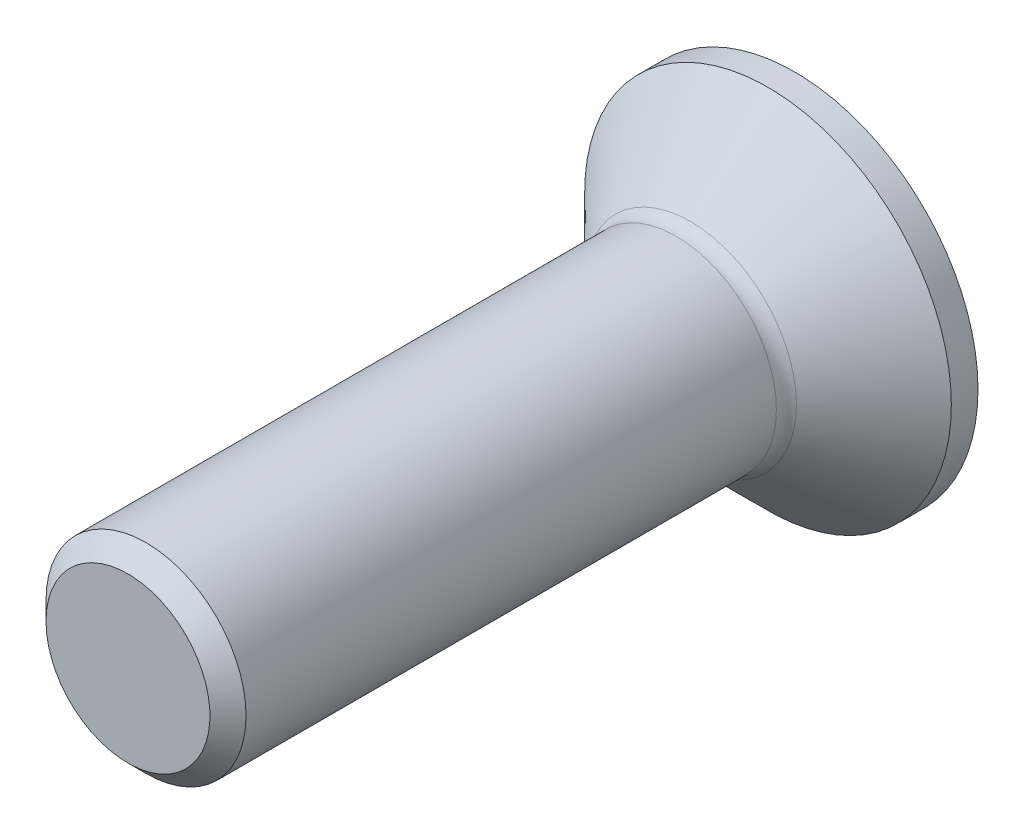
ISO-10303-21;
HEADER;
FILE_DESCRIPTION(('STEP AP214'),'2;1');
FILE_NAME('part.step','',(''),(''),'','','');
FILE_SCHEMA(('AUTOMOTIVE_DESIGN { 1 0 10303 214 1 1 1 1 }'));
ENDSEC;
DATA;
#1=APPLICATION_CONTEXT('core data for automotive mechanical design processes');
#2=APPLICATION_PROTOCOL_DEFINITION('international standard','automotive_design',2000,#1);
#3=PRODUCT_CONTEXT('',#1,'mechanical');
#4=PRODUCT('Part','Part','',(#3));
#5=PRODUCT_RELATED_PRODUCT_CATEGORY('part','',(#4));
#6=PRODUCT_DEFINITION_FORMATION('','',#4);
#7=PRODUCT_DEFINITION_CONTEXT('part definition',#1,'design');
#8=PRODUCT_DEFINITION('design','',#6,#7);
#9=PRODUCT_DEFINITION_SHAPE('','',#8);
#10=(LENGTH_UNIT() NAMED_UNIT(*) SI_UNIT(.MILLI.,.METRE.));
#11=(NAMED_UNIT(*) PLANE_ANGLE_UNIT() SI_UNIT($,.RADIAN.));
#12=(NAMED_UNIT(*) SI_UNIT($,.STERADIAN.) SOLID_ANGLE_UNIT());
#13=UNCERTAINTY_MEASURE_WITH_UNIT(LENGTH_MEASURE(1.E-05),#10,'distance_accuracy_value','');
#14=(GEOMETRIC_REPRESENTATION_CONTEXT(3) GLOBAL_UNCERTAINTY_ASSIGNED_CONTEXT((#13)) GLOBAL_UNIT_ASSIGNED_CONTEXT((#10,
#11,#12)) REPRESENTATION_CONTEXT('',''));
#15=CARTESIAN_POINT('',(0.,0.,0.));
#16=DIRECTION('',(0.,0.,1.));
#17=DIRECTION('',(1.,0.,0.));
#18=AXIS2_PLACEMENT_3D('',#15,#16,#17);
#19=CARTESIAN_POINT('',(0.,0.,-1.65));
#20=DIRECTION('',(0.,0.,-1.));
#21=DIRECTION('',(-1.,0.,0.));
#22=AXIS2_PLACEMENT_3D('',#19,#20,#21);
#23=CONICAL_SURFACE('',#22,3.15000000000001,0.78539816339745);
#24=CARTESIAN_POINT('',(0.,0.,-0.0878679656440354));
#25=DIRECTION('',(0.,0.,-1.));
#26=DIRECTION('',(-1.,0.,0.));
#27=AXIS2_PLACEMENT_3D('',#24,#25,#26);
#28=CIRCLE('',#27,1.58786796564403);
#29=CARTESIAN_POINT('',(-1.58786796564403,0.,-0.0878679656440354));
#30=VERTEX_POINT('',#29);
#31=EDGE_CURVE('E12',#30,#30,#28,.T.);
#32=ORIENTED_EDGE('',*,*,#31,.T.);
#33=EDGE_LOOP('',(#32));
#34=FACE_BOUND('',#33,.T.);
#35=CARTESIAN_POINT('',(0.,0.,-1.25));
#36=DIRECTION('',(0.,0.,-1.));
#37=DIRECTION('',(-1.,0.,0.));
#38=AXIS2_PLACEMENT_3D('',#35,#36,#37);
#39=CIRCLE('',#38,2.75);
#40=CARTESIAN_POINT('',(-2.75,0.,-1.25));
#41=VERTEX_POINT('',#40);
#42=EDGE_CURVE('E31',#41,#41,#39,.T.);
#43=ORIENTED_EDGE('',*,*,#42,.F.);
#44=EDGE_LOOP('',(#43));
#45=FACE_BOUND('',#44,.T.);
#46=ADVANCED_FACE('F27',(#34,#45),#23,.T.);
#47=CARTESIAN_POINT('',(0.,0.,8.35));
#48=DIRECTION('',(0.,0.,1.));
#49=DIRECTION('',(1.,0.,0.));
#50=AXIS2_PLACEMENT_3D('',#47,#48,#49);
#51=CYLINDRICAL_SURFACE('',#50,1.5);
#52=CARTESIAN_POINT('',(0.,0.,0.124264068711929));
#53=DIRECTION('',(0.,0.,1.));
#54=DIRECTION('',(1.,0.,0.));
#55=AXIS2_PLACEMENT_3D('',#52,#53,#54);
#56=CIRCLE('',#55,1.5);
#57=CARTESIAN_POINT('',(1.5,0.,0.124264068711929));
#58=VERTEX_POINT('',#57);
#59=EDGE_CURVE('E36',#58,#58,#56,.T.);
#60=ORIENTED_EDGE('',*,*,#59,.T.);
#61=EDGE_LOOP('',(#60));
#62=FACE_BOUND('',#61,.T.);
#63=CARTESIAN_POINT('',(0.,0.,8.079375));
#64=DIRECTION('',(0.,0.,-1.));
#65=DIRECTION('',(-1.,0.,0.));
#66=AXIS2_PLACEMENT_3D('',#63,#64,#65);
#67=CIRCLE('',#66,1.5);
#68=CARTESIAN_POINT('',(-1.5,0.,8.079375));
#69=VERTEX_POINT('',#68);
#70=EDGE_CURVE('E177',#69,#69,#67,.T.);
#71=ORIENTED_EDGE('',*,*,#70,.T.);
#72=EDGE_LOOP('',(#71));
#73=FACE_BOUND('',#72,.T.);
#74=ADVANCED_FACE('F29',(#62,#73),#51,.T.);
#75=CARTESIAN_POINT('',(0.,1.5,8.35));
#76=DIRECTION('',(0.,0.,-1.));
#77=DIRECTION('',(-1.,0.,0.));
#78=AXIS2_PLACEMENT_3D('',#75,#76,#77);
#79=PLANE('',#78);
#80=CARTESIAN_POINT('',(0.,0.,8.35));
#81=DIRECTION('',(0.,0.,-1.));
#82=DIRECTION('',(-1.,0.,0.));
#83=AXIS2_PLACEMENT_3D('',#80,#81,#82);
#84=CIRCLE('',#83,1.229375);
#85=CARTESIAN_POINT('',(-1.229375,0.,8.35));
#86=VERTEX_POINT('',#85);
#87=EDGE_CURVE('E174',#86,#86,#84,.F.);
#88=ORIENTED_EDGE('',*,*,#87,.T.);
#89=EDGE_LOOP('',(#88));
#90=FACE_BOUND('',#89,.T.);
#91=ADVANCED_FACE('F199',(#90),#79,.F.);
#92=CARTESIAN_POINT('',(0.,0.,8.35));
#93=DIRECTION('',(0.,0.,-1.));
#94=DIRECTION('',(-1.,0.,0.));
#95=AXIS2_PLACEMENT_3D('',#92,#93,#94);
#96=CONICAL_SURFACE('',#95,1.229375,0.785398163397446);
#97=ORIENTED_EDGE('',*,*,#70,.F.);
#98=EDGE_LOOP('',(#97));
#99=FACE_BOUND('',#98,.T.);
#100=ORIENTED_EDGE('',*,*,#87,.F.);
#101=EDGE_LOOP('',(#100));
#102=FACE_BOUND('',#101,.T.);
#103=ADVANCED_FACE('F188',(#99,#102),#96,.T.);
#104=CARTESIAN_POINT('',(0.,0.,0.124264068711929));
#105=DIRECTION('',(0.,0.,1.));
#106=DIRECTION('',(1.,0.,0.));
#107=AXIS2_PLACEMENT_3D('',#104,#105,#106);
#108=TOROIDAL_SURFACE('',#107,1.8,0.3);
#109=ORIENTED_EDGE('',*,*,#31,.F.);
#110=EDGE_LOOP('',(#109));
#111=FACE_BOUND('',#110,.T.);
#112=ORIENTED_EDGE('',*,*,#59,.F.);
#113=EDGE_LOOP('',(#112));
#114=FACE_BOUND('',#113,.T.);
#115=ADVANCED_FACE('F185',(#111,#114),#108,.F.);
#116=CARTESIAN_POINT('',(0.,0.,8.35));
#117=DIRECTION('',(0.,0.,-1.));
#118=DIRECTION('',(-1.,0.,0.));
#119=AXIS2_PLACEMENT_3D('',#116,#117,#118);
#120=CYLINDRICAL_SURFACE('',#119,2.75);
#121=CARTESIAN_POINT('',(0.,0.,-1.65));
#122=DIRECTION('',(0.,0.,-1.));
#123=DIRECTION('',(-1.,0.,0.));
#124=AXIS2_PLACEMENT_3D('',#121,#122,#123);
#125=CIRCLE('',#124,2.75);
#126=CARTESIAN_POINT('',(-2.75,0.,-1.65));
#127=VERTEX_POINT('',#126);
#128=EDGE_CURVE('E170',#127,#127,#125,.T.);
#129=ORIENTED_EDGE('',*,*,#128,.F.);
#130=EDGE_LOOP('',(#129));
#131=FACE_BOUND('',#130,.T.);
#132=ORIENTED_EDGE('',*,*,#42,.T.);
#133=EDGE_LOOP('',(#132));
#134=FACE_BOUND('',#133,.T.);
#135=ADVANCED_FACE('F187',(#131,#134),#120,.T.);
#136=CARTESIAN_POINT('',(0.,3.15000000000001,-1.65));
#137=DIRECTION('',(0.,0.,1.));
#138=DIRECTION('',(1.,0.,0.));
#139=AXIS2_PLACEMENT_3D('',#136,#137,#138);
#140=PLANE('',#139);
#141=DIRECTION('',(-0.499999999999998,-0.86602540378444,0.));
#142=VECTOR('',#141,1.);
#143=CARTESIAN_POINT('',(0.577350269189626,-1.,-1.65));
#144=LINE('',#143,#142);
#145=CARTESIAN_POINT('',(1.15470053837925,0.,-1.65));
#146=VERTEX_POINT('',#145);
#147=CARTESIAN_POINT('',(0.577350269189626,-1.,-1.65));
#148=VERTEX_POINT('',#147);
#149=EDGE_CURVE('E104',#146,#148,#144,.T.);
#150=ORIENTED_EDGE('',*,*,#149,.F.);
#151=DIRECTION('',(0.499999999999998,-0.86602540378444,0.));
#152=VECTOR('',#151,1.);
#153=CARTESIAN_POINT('',(1.15470053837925,0.,-1.65));
#154=LINE('',#153,#152);
#155=CARTESIAN_POINT('',(0.577350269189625,1.,-1.65));
#156=VERTEX_POINT('',#155);
#157=EDGE_CURVE('E43',#156,#146,#154,.T.);
#158=ORIENTED_EDGE('',*,*,#157,.F.);
#159=DIRECTION('',(1.,0.,0.));
#160=VECTOR('',#159,1.);
#161=CARTESIAN_POINT('',(0.577350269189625,1.,-1.65));
#162=LINE('',#161,#160);
#163=CARTESIAN_POINT('',(-0.577350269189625,1.,-1.65));
#164=VERTEX_POINT('',#163);
#165=EDGE_CURVE('E134',#164,#156,#162,.T.);
#166=ORIENTED_EDGE('',*,*,#165,.F.);
#167=DIRECTION('',(0.499999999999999,0.866025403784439,0.));
#168=VECTOR('',#167,1.);
#169=CARTESIAN_POINT('',(-0.577350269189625,1.,-1.65));
#170=LINE('',#169,#168);
#171=CARTESIAN_POINT('',(-1.15470053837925,0.,-1.65));
#172=VERTEX_POINT('',#171);
#173=EDGE_CURVE('E129',#172,#164,#170,.T.);
#174=ORIENTED_EDGE('',*,*,#173,.F.);
#175=DIRECTION('',(-0.499999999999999,0.866025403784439,0.));
#176=VECTOR('',#175,1.);
#177=CARTESIAN_POINT('',(-1.15470053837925,0.,-1.65));
#178=LINE('',#177,#176);
#179=CARTESIAN_POINT('',(-0.577350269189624,-1.,-1.65));
#180=VERTEX_POINT('',#179);
#181=EDGE_CURVE('E127',#180,#172,#178,.T.);
#182=ORIENTED_EDGE('',*,*,#181,.F.);
#183=DIRECTION('',(-1.,0.,0.));
#184=VECTOR('',#183,1.);
#185=CARTESIAN_POINT('',(-0.577350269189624,-1.,-1.65));
#186=LINE('',#185,#184);
#187=EDGE_CURVE('E112',#148,#180,#186,.T.);
#188=ORIENTED_EDGE('',*,*,#187,.F.);
#189=EDGE_LOOP('',(#150,#158,#166,#174,#182,#188));
#190=FACE_BOUND('',#189,.T.);
#191=ORIENTED_EDGE('',*,*,#128,.T.);
#192=EDGE_LOOP('',(#191));
#193=FACE_BOUND('',#192,.T.);
#194=ADVANCED_FACE('F124',(#190,#193),#140,.F.);
#195=CARTESIAN_POINT('',(1.15470053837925,0.,-0.6));
#196=DIRECTION('',(0.86602540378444,0.499999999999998,0.));
#197=DIRECTION('',(-0.499999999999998,0.86602540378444,0.));
#198=AXIS2_PLACEMENT_3D('',#195,#196,#197);
#199=PLANE('',#198);
#200=ORIENTED_EDGE('',*,*,#157,.T.);
#201=DIRECTION('',(0.,0.,-1.));
#202=VECTOR('',#201,1.);
#203=CARTESIAN_POINT('',(1.15470053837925,0.,-0.6));
#204=LINE('',#203,#202);
#205=CARTESIAN_POINT('',(1.15470053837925,0.,-0.6));
#206=VERTEX_POINT('',#205);
#207=EDGE_CURVE('E109',#206,#146,#204,.T.);
#208=ORIENTED_EDGE('',*,*,#207,.F.);
#209=DIRECTION('',(0.499999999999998,-0.86602540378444,0.));
#210=VECTOR('',#209,1.);
#211=CARTESIAN_POINT('',(1.15470053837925,0.,-0.6));
#212=LINE('',#211,#210);
#213=CARTESIAN_POINT('',(0.866025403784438,0.499999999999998,-0.6));
#214=VERTEX_POINT('',#213);
#215=EDGE_CURVE('E136',#214,#206,#212,.T.);
#216=ORIENTED_EDGE('',*,*,#215,.F.);
#217=CARTESIAN_POINT('',(0.577350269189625,1.,-0.6));
#218=VERTEX_POINT('',#217);
#219=EDGE_CURVE('E137',#218,#214,#212,.T.);
#220=ORIENTED_EDGE('',*,*,#219,.F.);
#221=DIRECTION('',(0.,0.,-1.));
#222=VECTOR('',#221,1.);
#223=CARTESIAN_POINT('',(0.577350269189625,1.,-0.6));
#224=LINE('',#223,#222);
#225=EDGE_CURVE('E156',#218,#156,#224,.T.);
#226=ORIENTED_EDGE('',*,*,#225,.T.);
#227=EDGE_LOOP('',(#200,#208,#216,#220,#226));
#228=FACE_BOUND('',#227,.T.);
#229=ADVANCED_FACE('F210',(#228),#199,.F.);
#230=CARTESIAN_POINT('',(0.577350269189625,1.,-0.6));
#231=DIRECTION('',(0.,1.,0.));
#232=DIRECTION('',(-1.,0.,0.));
#233=AXIS2_PLACEMENT_3D('',#230,#231,#232);
#234=PLANE('',#233);
#235=ORIENTED_EDGE('',*,*,#165,.T.);
#236=ORIENTED_EDGE('',*,*,#225,.F.);
#237=DIRECTION('',(1.,0.,0.));
#238=VECTOR('',#237,1.);
#239=CARTESIAN_POINT('',(0.577350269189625,1.,-0.6));
#240=LINE('',#239,#238);
#241=CARTESIAN_POINT('',(0.,0.999999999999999,-0.6));
#242=VERTEX_POINT('',#241);
#243=EDGE_CURVE('E152',#242,#218,#240,.T.);
#244=ORIENTED_EDGE('',*,*,#243,.F.);
#245=CARTESIAN_POINT('',(-0.577350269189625,1.,-0.6));
#246=VERTEX_POINT('',#245);
#247=EDGE_CURVE('E153',#246,#242,#240,.T.);
#248=ORIENTED_EDGE('',*,*,#247,.F.);
#249=DIRECTION('',(0.,0.,-1.));
#250=VECTOR('',#249,1.);
#251=CARTESIAN_POINT('',(-0.577350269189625,1.,-0.6));
#252=LINE('',#251,#250);
#253=EDGE_CURVE('E159',#246,#164,#252,.T.);
#254=ORIENTED_EDGE('',*,*,#253,.T.);
#255=EDGE_LOOP('',(#235,#236,#244,#248,#254));
#256=FACE_BOUND('',#255,.T.);
#257=ADVANCED_FACE('F254',(#256),#234,.F.);
#258=CARTESIAN_POINT('',(-0.577350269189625,1.,-0.6));
#259=DIRECTION('',(-0.866025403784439,0.499999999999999,0.));
#260=DIRECTION('',(-0.499999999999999,-0.866025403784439,0.));
#261=AXIS2_PLACEMENT_3D('',#258,#259,#260);
#262=PLANE('',#261);
#263=ORIENTED_EDGE('',*,*,#173,.T.);
#264=ORIENTED_EDGE('',*,*,#253,.F.);
#265=DIRECTION('',(0.499999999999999,0.866025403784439,0.));
#266=VECTOR('',#265,1.);
#267=CARTESIAN_POINT('',(-0.577350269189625,1.,-0.6));
#268=LINE('',#267,#266);
#269=CARTESIAN_POINT('',(-0.866025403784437,0.499999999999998,-0.6));
#270=VERTEX_POINT('',#269);
#271=EDGE_CURVE('E148',#270,#246,#268,.T.);
#272=ORIENTED_EDGE('',*,*,#271,.F.);
#273=CARTESIAN_POINT('',(-1.15470053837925,0.,-0.6));
#274=VERTEX_POINT('',#273);
#275=EDGE_CURVE('E149',#274,#270,#268,.T.);
#276=ORIENTED_EDGE('',*,*,#275,.F.);
#277=DIRECTION('',(0.,0.,-1.));
#278=VECTOR('',#277,1.);
#279=CARTESIAN_POINT('',(-1.15470053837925,0.,-0.6));
#280=LINE('',#279,#278);
#281=EDGE_CURVE('E162',#274,#172,#280,.T.);
#282=ORIENTED_EDGE('',*,*,#281,.T.);
#283=EDGE_LOOP('',(#263,#264,#272,#276,#282));
#284=FACE_BOUND('',#283,.T.);
#285=ADVANCED_FACE('F261',(#284),#262,.F.);
#286=CARTESIAN_POINT('',(-1.15470053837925,0.,-0.6));
#287=DIRECTION('',(-0.866025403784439,-0.499999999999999,0.));
#288=DIRECTION('',(0.499999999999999,-0.866025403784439,0.));
#289=AXIS2_PLACEMENT_3D('',#286,#287,#288);
#290=PLANE('',#289);
#291=ORIENTED_EDGE('',*,*,#181,.T.);
#292=ORIENTED_EDGE('',*,*,#281,.F.);
#293=DIRECTION('',(-0.499999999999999,0.866025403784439,0.));
#294=VECTOR('',#293,1.);
#295=CARTESIAN_POINT('',(-1.15470053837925,0.,-0.6));
#296=LINE('',#295,#294);
#297=CARTESIAN_POINT('',(-0.866025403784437,-0.499999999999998,-0.6));
#298=VERTEX_POINT('',#297);
#299=EDGE_CURVE('E144',#298,#274,#296,.T.);
#300=ORIENTED_EDGE('',*,*,#299,.F.);
#301=CARTESIAN_POINT('',(-0.577350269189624,-1.,-0.6));
#302=VERTEX_POINT('',#301);
#303=EDGE_CURVE('E145',#302,#298,#296,.T.);
#304=ORIENTED_EDGE('',*,*,#303,.F.);
#305=DIRECTION('',(0.,0.,-1.));
#306=VECTOR('',#305,1.);
#307=CARTESIAN_POINT('',(-0.577350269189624,-1.,-0.6));
#308=LINE('',#307,#306);
#309=EDGE_CURVE('E121',#302,#180,#308,.T.);
#310=ORIENTED_EDGE('',*,*,#309,.T.);
#311=EDGE_LOOP('',(#291,#292,#300,#304,#310));
#312=FACE_BOUND('',#311,.T.);
#313=ADVANCED_FACE('F269',(#312),#290,.F.);
#314=CARTESIAN_POINT('',(-0.577350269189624,-1.,-0.6));
#315=DIRECTION('',(0.,-1.,0.));
#316=DIRECTION('',(1.,0.,0.));
#317=AXIS2_PLACEMENT_3D('',#314,#315,#316);
#318=PLANE('',#317);
#319=ORIENTED_EDGE('',*,*,#187,.T.);
#320=ORIENTED_EDGE('',*,*,#309,.F.);
#321=DIRECTION('',(-1.,0.,0.));
#322=VECTOR('',#321,1.);
#323=CARTESIAN_POINT('',(-0.577350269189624,-1.,-0.6));
#324=LINE('',#323,#322);
#325=CARTESIAN_POINT('',(0.,-0.999999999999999,-0.6));
#326=VERTEX_POINT('',#325);
#327=EDGE_CURVE('E142',#326,#302,#324,.T.);
#328=ORIENTED_EDGE('',*,*,#327,.F.);
#329=CARTESIAN_POINT('',(0.577350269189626,-1.,-0.6));
#330=VERTEX_POINT('',#329);
#331=EDGE_CURVE('E120',#330,#326,#324,.T.);
#332=ORIENTED_EDGE('',*,*,#331,.F.);
#333=DIRECTION('',(0.,0.,-1.));
#334=VECTOR('',#333,1.);
#335=CARTESIAN_POINT('',(0.577350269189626,-1.,-0.6));
#336=LINE('',#335,#334);
#337=EDGE_CURVE('E107',#330,#148,#336,.T.);
#338=ORIENTED_EDGE('',*,*,#337,.T.);
#339=EDGE_LOOP('',(#319,#320,#328,#332,#338));
#340=FACE_BOUND('',#339,.T.);
#341=ADVANCED_FACE('F115',(#340),#318,.F.);
#342=CARTESIAN_POINT('',(0.577350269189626,-1.,-0.6));
#343=DIRECTION('',(0.86602540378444,-0.499999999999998,0.));
#344=DIRECTION('',(0.499999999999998,0.86602540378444,0.));
#345=AXIS2_PLACEMENT_3D('',#342,#343,#344);
#346=PLANE('',#345);
#347=ORIENTED_EDGE('',*,*,#149,.T.);
#348=ORIENTED_EDGE('',*,*,#337,.F.);
#349=DIRECTION('',(-0.499999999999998,-0.86602540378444,0.));
#350=VECTOR('',#349,1.);
#351=CARTESIAN_POINT('',(0.577350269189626,-1.,-0.6));
#352=LINE('',#351,#350);
#353=CARTESIAN_POINT('',(0.86602540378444,-0.499999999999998,-0.6));
#354=VERTEX_POINT('',#353);
#355=EDGE_CURVE('E140',#354,#330,#352,.T.);
#356=ORIENTED_EDGE('',*,*,#355,.F.);
#357=EDGE_CURVE('E51',#206,#354,#352,.T.);
#358=ORIENTED_EDGE('',*,*,#357,.F.);
#359=ORIENTED_EDGE('',*,*,#207,.T.);
#360=EDGE_LOOP('',(#347,#348,#356,#358,#359));
#361=FACE_BOUND('',#360,.T.);
#362=ADVANCED_FACE('F106',(#361),#346,.F.);
#363=CARTESIAN_POINT('',(0.577350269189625,1.,-0.6));
#364=DIRECTION('',(0.,0.,1.));
#365=DIRECTION('',(1.,0.,0.));
#366=AXIS2_PLACEMENT_3D('',#363,#364,#365);
#367=PLANE('',#366);
#368=ORIENTED_EDGE('',*,*,#355,.T.);
#369=ORIENTED_EDGE('',*,*,#331,.T.);
#370=CARTESIAN_POINT('',(0.,0.,-0.6));
#371=DIRECTION('',(0.,0.,-1.));
#372=DIRECTION('',(-1.,0.,0.));
#373=AXIS2_PLACEMENT_3D('',#370,#371,#372);
#374=CIRCLE('',#373,1.);
#375=EDGE_CURVE('E337',#354,#326,#374,.T.);
#376=ORIENTED_EDGE('',*,*,#375,.F.);
#377=EDGE_LOOP('',(#368,#369,#376));
#378=FACE_BOUND('',#377,.T.);
#379=ADVANCED_FACE('F290',(#378),#367,.F.);
#380=ORIENTED_EDGE('',*,*,#327,.T.);
#381=ORIENTED_EDGE('',*,*,#303,.T.);
#382=EDGE_CURVE('E340',#326,#298,#374,.T.);
#383=ORIENTED_EDGE('',*,*,#382,.F.);
#384=EDGE_LOOP('',(#380,#381,#383));
#385=FACE_BOUND('',#384,.T.);
#386=ADVANCED_FACE('F297',(#385),#367,.F.);
#387=ORIENTED_EDGE('',*,*,#299,.T.);
#388=ORIENTED_EDGE('',*,*,#275,.T.);
#389=EDGE_CURVE('E158',#298,#270,#374,.T.);
#390=ORIENTED_EDGE('',*,*,#389,.F.);
#391=EDGE_LOOP('',(#387,#388,#390));
#392=FACE_BOUND('',#391,.T.);
#393=ADVANCED_FACE('F305',(#392),#367,.F.);
#394=ORIENTED_EDGE('',*,*,#271,.T.);
#395=ORIENTED_EDGE('',*,*,#247,.T.);
#396=EDGE_CURVE('E167',#270,#242,#374,.T.);
#397=ORIENTED_EDGE('',*,*,#396,.F.);
#398=EDGE_LOOP('',(#394,#395,#397));
#399=FACE_BOUND('',#398,.T.);
#400=ADVANCED_FACE('F312',(#399),#367,.F.);
#401=ORIENTED_EDGE('',*,*,#243,.T.);
#402=ORIENTED_EDGE('',*,*,#219,.T.);
#403=EDGE_CURVE('E171',#242,#214,#374,.T.);
#404=ORIENTED_EDGE('',*,*,#403,.F.);
#405=EDGE_LOOP('',(#401,#402,#404));
#406=FACE_BOUND('',#405,.T.);
#407=ADVANCED_FACE('F319',(#406),#367,.F.);
#408=ORIENTED_EDGE('',*,*,#215,.T.);
#409=ORIENTED_EDGE('',*,*,#357,.T.);
#410=EDGE_CURVE('E333',#214,#354,#374,.T.);
#411=ORIENTED_EDGE('',*,*,#410,.F.);
#412=EDGE_LOOP('',(#408,#409,#411));
#413=FACE_BOUND('',#412,.T.);
#414=ADVANCED_FACE('F246',(#413),#367,.F.);
#415=CARTESIAN_POINT('',(0.,0.,-0.6));
#416=DIRECTION('',(0.,0.,-1.));
#417=DIRECTION('',(-1.,0.,0.));
#418=AXIS2_PLACEMENT_3D('',#415,#416,#417);
#419=CONICAL_SURFACE('',#418,1.,1.0471975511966);
#420=CARTESIAN_POINT('',(0.,0.,-0.0226497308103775));
#421=VERTEX_POINT('',#420);
#422=VERTEX_LOOP('',#421);
#423=FACE_BOUND('',#422,.T.);
#424=ORIENTED_EDGE('',*,*,#396,.T.);
#425=ORIENTED_EDGE('',*,*,#403,.T.);
#426=ORIENTED_EDGE('',*,*,#410,.T.);
#427=ORIENTED_EDGE('',*,*,#375,.T.);
#428=ORIENTED_EDGE('',*,*,#382,.T.);
#429=ORIENTED_EDGE('',*,*,#389,.T.);
#430=EDGE_LOOP('',(#424,#425,#426,#427,#428,#429));
#431=FACE_BOUND('',#430,.T.);
#432=ADVANCED_FACE('F241',(#423,#431),#419,.F.);
#433=CLOSED_SHELL('',(#46,#74,#91,#103,#115,#135,#194,#229,#257,#285,#313,#341,#362,#379,#386,
#393,#400,#407,#414,#432));
#434=MANIFOLD_SOLID_BREP('B2',#433);
#435=ADVANCED_BREP_SHAPE_REPRESENTATION('',(#18,#434),#14);
#436=SHAPE_DEFINITION_REPRESENTATION(#9,#435);
ENDSEC;
END-ISO-10303-21;
